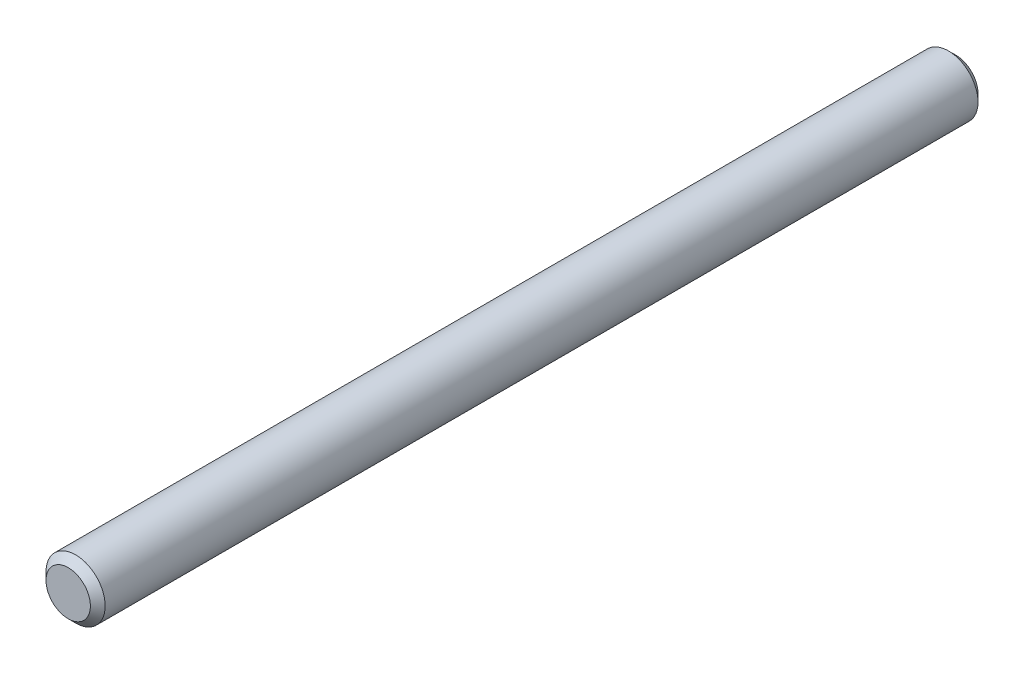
from build123d import *

# Parameters (mm, degrees)
SKETCH_1_R      = 2
EXTRUDE_1_DEPTH = 60
CHAMFER_1_SIZE  = 0.5


with BuildPart() as part:
    # Sketch 1 → Extrude 1 (new body)
    with BuildSketch(Plane.XY):
        Circle(SKETCH_1_R)
    extrude(amount=-EXTRUDE_1_DEPTH)

    # Chamfer 1
    chamfer_1_edges = [part.edges().sort_by_distance(p)[0] for p in [
        (-2, 0, 0),
        (-2, 0, -60),
    ]]
    chamfer(chamfer_1_edges, length=CHAMFER_1_SIZE)


solid = part.part
